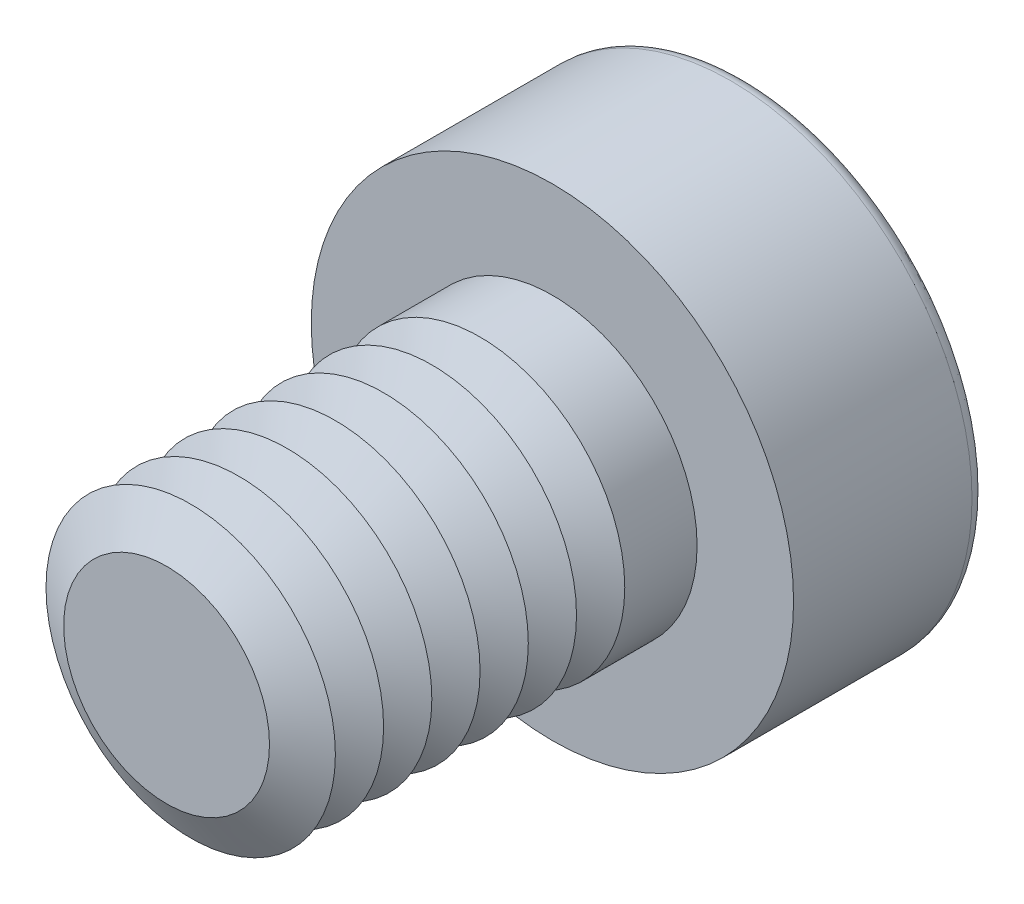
ISO-10303-21;
HEADER;
FILE_DESCRIPTION(('STEP AP214'),'2;1');
FILE_NAME('part.step','',(''),(''),'','','');
FILE_SCHEMA(('AUTOMOTIVE_DESIGN { 1 0 10303 214 1 1 1 1 }'));
ENDSEC;
DATA;
#1=APPLICATION_CONTEXT('core data for automotive mechanical design processes');
#2=APPLICATION_PROTOCOL_DEFINITION('international standard','automotive_design',2000,#1);
#3=PRODUCT_CONTEXT('',#1,'mechanical');
#4=PRODUCT('Part','Part','',(#3));
#5=PRODUCT_RELATED_PRODUCT_CATEGORY('part','',(#4));
#6=PRODUCT_DEFINITION_FORMATION('','',#4);
#7=PRODUCT_DEFINITION_CONTEXT('part definition',#1,'design');
#8=PRODUCT_DEFINITION('design','',#6,#7);
#9=PRODUCT_DEFINITION_SHAPE('','',#8);
#10=(LENGTH_UNIT() NAMED_UNIT(*) SI_UNIT(.MILLI.,.METRE.));
#11=(NAMED_UNIT(*) PLANE_ANGLE_UNIT() SI_UNIT($,.RADIAN.));
#12=(NAMED_UNIT(*) SI_UNIT($,.STERADIAN.) SOLID_ANGLE_UNIT());
#13=UNCERTAINTY_MEASURE_WITH_UNIT(LENGTH_MEASURE(1.E-05),#10,'distance_accuracy_value','');
#14=(GEOMETRIC_REPRESENTATION_CONTEXT(3) GLOBAL_UNCERTAINTY_ASSIGNED_CONTEXT((#13)) GLOBAL_UNIT_ASSIGNED_CONTEXT((#10,
#11,#12)) REPRESENTATION_CONTEXT('',''));
#15=CARTESIAN_POINT('',(0.,0.,0.));
#16=DIRECTION('',(0.,0.,1.));
#17=DIRECTION('',(1.,0.,0.));
#18=AXIS2_PLACEMENT_3D('',#15,#16,#17);
#19=CARTESIAN_POINT('',(0.,0.,4.5));
#20=DIRECTION('',(0.,0.,1.));
#21=DIRECTION('',(1.,0.,0.));
#22=AXIS2_PLACEMENT_3D('',#19,#20,#21);
#23=CONICAL_SURFACE('',#22,3.,1.0471975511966);
#24=CARTESIAN_POINT('',(0.,0.,4.));
#25=DIRECTION('',(0.,0.,1.));
#26=DIRECTION('',(1.,0.,0.));
#27=AXIS2_PLACEMENT_3D('',#24,#25,#26);
#28=CIRCLE('',#27,2.13397459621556);
#29=CARTESIAN_POINT('',(2.13397459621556,0.,4.));
#30=VERTEX_POINT('',#29);
#31=EDGE_CURVE('E311',#30,#30,#28,.T.);
#32=ORIENTED_EDGE('',*,*,#31,.T.);
#33=EDGE_LOOP('',(#32));
#34=FACE_BOUND('',#33,.T.);
#35=CARTESIAN_POINT('',(0.,0.,4.5));
#36=DIRECTION('',(0.,0.,1.));
#37=DIRECTION('',(1.,0.,0.));
#38=AXIS2_PLACEMENT_3D('',#35,#36,#37);
#39=CIRCLE('',#38,3.);
#40=CARTESIAN_POINT('',(3.,0.,4.5));
#41=VERTEX_POINT('',#40);
#42=EDGE_CURVE('E314',#41,#41,#39,.T.);
#43=ORIENTED_EDGE('',*,*,#42,.F.);
#44=EDGE_LOOP('',(#43));
#45=FACE_BOUND('',#44,.T.);
#46=ADVANCED_FACE('F39',(#34,#45),#23,.T.);
#47=CARTESIAN_POINT('',(0.,0.,4.));
#48=DIRECTION('',(0.,0.,-1.));
#49=DIRECTION('',(-1.,0.,0.));
#50=AXIS2_PLACEMENT_3D('',#47,#48,#49);
#51=CONICAL_SURFACE('',#50,2.13397459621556,1.0471975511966);
#52=CARTESIAN_POINT('',(0.,0.,3.5));
#53=DIRECTION('',(0.,0.,1.));
#54=DIRECTION('',(1.,0.,0.));
#55=AXIS2_PLACEMENT_3D('',#52,#53,#54);
#56=CIRCLE('',#55,3.);
#57=CARTESIAN_POINT('',(3.,0.,3.5));
#58=VERTEX_POINT('',#57);
#59=EDGE_CURVE('E322',#58,#58,#56,.T.);
#60=ORIENTED_EDGE('',*,*,#59,.T.);
#61=EDGE_LOOP('',(#60));
#62=FACE_BOUND('',#61,.T.);
#63=ORIENTED_EDGE('',*,*,#31,.F.);
#64=EDGE_LOOP('',(#63));
#65=FACE_BOUND('',#64,.T.);
#66=ADVANCED_FACE('F244',(#62,#65),#51,.T.);
#67=CARTESIAN_POINT('',(0.,0.,8.));
#68=DIRECTION('',(0.,0.,1.));
#69=DIRECTION('',(1.,0.,0.));
#70=AXIS2_PLACEMENT_3D('',#67,#68,#69);
#71=PLANE('',#70);
#72=CARTESIAN_POINT('',(0.,0.,8.));
#73=DIRECTION('',(0.,0.,1.));
#74=DIRECTION('',(1.,0.,0.));
#75=AXIS2_PLACEMENT_3D('',#72,#73,#74);
#76=CIRCLE('',#75,2.13397459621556);
#77=CARTESIAN_POINT('',(2.13397459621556,0.,8.));
#78=VERTEX_POINT('',#77);
#79=EDGE_CURVE('E173',#78,#78,#76,.T.);
#80=ORIENTED_EDGE('',*,*,#79,.T.);
#81=EDGE_LOOP('',(#80));
#82=FACE_BOUND('',#81,.T.);
#83=ADVANCED_FACE('F250',(#82),#71,.T.);
#84=CARTESIAN_POINT('',(0.,0.,8.));
#85=DIRECTION('',(0.,0.,-1.));
#86=DIRECTION('',(-1.,0.,0.));
#87=AXIS2_PLACEMENT_3D('',#84,#85,#86);
#88=CONICAL_SURFACE('',#87,2.13397459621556,1.0471975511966);
#89=CARTESIAN_POINT('',(0.,0.,7.5));
#90=DIRECTION('',(0.,0.,1.));
#91=DIRECTION('',(1.,0.,0.));
#92=AXIS2_PLACEMENT_3D('',#89,#90,#91);
#93=CIRCLE('',#92,3.);
#94=CARTESIAN_POINT('',(3.,0.,7.5));
#95=VERTEX_POINT('',#94);
#96=EDGE_CURVE('E290',#95,#95,#93,.T.);
#97=ORIENTED_EDGE('',*,*,#96,.T.);
#98=EDGE_LOOP('',(#97));
#99=FACE_BOUND('',#98,.T.);
#100=ORIENTED_EDGE('',*,*,#79,.F.);
#101=EDGE_LOOP('',(#100));
#102=FACE_BOUND('',#101,.T.);
#103=ADVANCED_FACE('F198',(#99,#102),#88,.T.);
#104=CARTESIAN_POINT('',(0.,0.,7.5));
#105=DIRECTION('',(0.,0.,1.));
#106=DIRECTION('',(1.,0.,0.));
#107=AXIS2_PLACEMENT_3D('',#104,#105,#106);
#108=CONICAL_SURFACE('',#107,3.,1.0471975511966);
#109=CARTESIAN_POINT('',(0.,0.,7.));
#110=DIRECTION('',(0.,0.,1.));
#111=DIRECTION('',(1.,0.,0.));
#112=AXIS2_PLACEMENT_3D('',#109,#110,#111);
#113=CIRCLE('',#112,2.13397459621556);
#114=CARTESIAN_POINT('',(2.13397459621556,0.,7.));
#115=VERTEX_POINT('',#114);
#116=EDGE_CURVE('E287',#115,#115,#113,.T.);
#117=ORIENTED_EDGE('',*,*,#116,.T.);
#118=EDGE_LOOP('',(#117));
#119=FACE_BOUND('',#118,.T.);
#120=ORIENTED_EDGE('',*,*,#96,.F.);
#121=EDGE_LOOP('',(#120));
#122=FACE_BOUND('',#121,.T.);
#123=ADVANCED_FACE('F276',(#119,#122),#108,.T.);
#124=CARTESIAN_POINT('',(0.,0.,7.));
#125=DIRECTION('',(0.,0.,-1.));
#126=DIRECTION('',(-1.,0.,0.));
#127=AXIS2_PLACEMENT_3D('',#124,#125,#126);
#128=CONICAL_SURFACE('',#127,2.13397459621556,1.0471975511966);
#129=CARTESIAN_POINT('',(0.,0.,6.5));
#130=DIRECTION('',(0.,0.,1.));
#131=DIRECTION('',(1.,0.,0.));
#132=AXIS2_PLACEMENT_3D('',#129,#130,#131);
#133=CIRCLE('',#132,3.);
#134=CARTESIAN_POINT('',(3.,0.,6.5));
#135=VERTEX_POINT('',#134);
#136=EDGE_CURVE('E298',#135,#135,#133,.T.);
#137=ORIENTED_EDGE('',*,*,#136,.T.);
#138=EDGE_LOOP('',(#137));
#139=FACE_BOUND('',#138,.T.);
#140=ORIENTED_EDGE('',*,*,#116,.F.);
#141=EDGE_LOOP('',(#140));
#142=FACE_BOUND('',#141,.T.);
#143=ADVANCED_FACE('F273',(#139,#142),#128,.T.);
#144=CARTESIAN_POINT('',(0.,0.,6.5));
#145=DIRECTION('',(0.,0.,1.));
#146=DIRECTION('',(1.,0.,0.));
#147=AXIS2_PLACEMENT_3D('',#144,#145,#146);
#148=CONICAL_SURFACE('',#147,3.,1.0471975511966);
#149=CARTESIAN_POINT('',(0.,0.,6.));
#150=DIRECTION('',(0.,0.,1.));
#151=DIRECTION('',(1.,0.,0.));
#152=AXIS2_PLACEMENT_3D('',#149,#150,#151);
#153=CIRCLE('',#152,2.13397459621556);
#154=CARTESIAN_POINT('',(2.13397459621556,0.,6.));
#155=VERTEX_POINT('',#154);
#156=EDGE_CURVE('E292',#155,#155,#153,.T.);
#157=ORIENTED_EDGE('',*,*,#156,.T.);
#158=EDGE_LOOP('',(#157));
#159=FACE_BOUND('',#158,.T.);
#160=ORIENTED_EDGE('',*,*,#136,.F.);
#161=EDGE_LOOP('',(#160));
#162=FACE_BOUND('',#161,.T.);
#163=ADVANCED_FACE('F269',(#159,#162),#148,.T.);
#164=CARTESIAN_POINT('',(0.,0.,6.));
#165=DIRECTION('',(0.,0.,-1.));
#166=DIRECTION('',(-1.,0.,0.));
#167=AXIS2_PLACEMENT_3D('',#164,#165,#166);
#168=CONICAL_SURFACE('',#167,2.13397459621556,1.0471975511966);
#169=CARTESIAN_POINT('',(0.,0.,5.5));
#170=DIRECTION('',(0.,0.,1.));
#171=DIRECTION('',(1.,0.,0.));
#172=AXIS2_PLACEMENT_3D('',#169,#170,#171);
#173=CIRCLE('',#172,3.);
#174=CARTESIAN_POINT('',(3.,0.,5.5));
#175=VERTEX_POINT('',#174);
#176=EDGE_CURVE('E307',#175,#175,#173,.T.);
#177=ORIENTED_EDGE('',*,*,#176,.T.);
#178=EDGE_LOOP('',(#177));
#179=FACE_BOUND('',#178,.T.);
#180=ORIENTED_EDGE('',*,*,#156,.F.);
#181=EDGE_LOOP('',(#180));
#182=FACE_BOUND('',#181,.T.);
#183=ADVANCED_FACE('F265',(#179,#182),#168,.T.);
#184=CARTESIAN_POINT('',(0.,0.,5.5));
#185=DIRECTION('',(0.,0.,1.));
#186=DIRECTION('',(1.,0.,0.));
#187=AXIS2_PLACEMENT_3D('',#184,#185,#186);
#188=CONICAL_SURFACE('',#187,3.,1.0471975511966);
#189=CARTESIAN_POINT('',(0.,0.,5.));
#190=DIRECTION('',(0.,0.,1.));
#191=DIRECTION('',(1.,0.,0.));
#192=AXIS2_PLACEMENT_3D('',#189,#190,#191);
#193=CIRCLE('',#192,2.13397459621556);
#194=CARTESIAN_POINT('',(2.13397459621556,0.,5.));
#195=VERTEX_POINT('',#194);
#196=EDGE_CURVE('E304',#195,#195,#193,.T.);
#197=ORIENTED_EDGE('',*,*,#196,.T.);
#198=EDGE_LOOP('',(#197));
#199=FACE_BOUND('',#198,.T.);
#200=ORIENTED_EDGE('',*,*,#176,.F.);
#201=EDGE_LOOP('',(#200));
#202=FACE_BOUND('',#201,.T.);
#203=ADVANCED_FACE('F261',(#199,#202),#188,.T.);
#204=CARTESIAN_POINT('',(0.,0.,5.));
#205=DIRECTION('',(0.,0.,-1.));
#206=DIRECTION('',(-1.,0.,0.));
#207=AXIS2_PLACEMENT_3D('',#204,#205,#206);
#208=CONICAL_SURFACE('',#207,2.13397459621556,1.0471975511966);
#209=ORIENTED_EDGE('',*,*,#42,.T.);
#210=EDGE_LOOP('',(#209));
#211=FACE_BOUND('',#210,.T.);
#212=ORIENTED_EDGE('',*,*,#196,.F.);
#213=EDGE_LOOP('',(#212));
#214=FACE_BOUND('',#213,.T.);
#215=ADVANCED_FACE('F257',(#211,#214),#208,.T.);
#216=CARTESIAN_POINT('',(0.,0.,3.5));
#217=DIRECTION('',(0.,0.,1.));
#218=DIRECTION('',(1.,0.,0.));
#219=AXIS2_PLACEMENT_3D('',#216,#217,#218);
#220=CONICAL_SURFACE('',#219,3.,1.0471975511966);
#221=CARTESIAN_POINT('',(0.,0.,3.));
#222=DIRECTION('',(0.,0.,1.));
#223=DIRECTION('',(1.,0.,0.));
#224=AXIS2_PLACEMENT_3D('',#221,#222,#223);
#225=CIRCLE('',#224,2.13397459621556);
#226=CARTESIAN_POINT('',(2.13397459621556,0.,3.));
#227=VERTEX_POINT('',#226);
#228=EDGE_CURVE('E318',#227,#227,#225,.T.);
#229=ORIENTED_EDGE('',*,*,#228,.T.);
#230=EDGE_LOOP('',(#229));
#231=FACE_BOUND('',#230,.T.);
#232=ORIENTED_EDGE('',*,*,#59,.F.);
#233=EDGE_LOOP('',(#232));
#234=FACE_BOUND('',#233,.T.);
#235=ADVANCED_FACE('F260',(#231,#234),#220,.T.);
#236=CARTESIAN_POINT('',(0.,0.,3.));
#237=DIRECTION('',(0.,0.,-1.));
#238=DIRECTION('',(-1.,0.,0.));
#239=AXIS2_PLACEMENT_3D('',#236,#237,#238);
#240=CONICAL_SURFACE('',#239,2.13397459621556,1.0471975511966);
#241=CARTESIAN_POINT('',(0.,0.,2.5));
#242=DIRECTION('',(0.,0.,1.));
#243=DIRECTION('',(1.,0.,0.));
#244=AXIS2_PLACEMENT_3D('',#241,#242,#243);
#245=CIRCLE('',#244,3.);
#246=CARTESIAN_POINT('',(3.,0.,2.5));
#247=VERTEX_POINT('',#246);
#248=EDGE_CURVE('E334',#247,#247,#245,.T.);
#249=ORIENTED_EDGE('',*,*,#248,.T.);
#250=EDGE_LOOP('',(#249));
#251=FACE_BOUND('',#250,.T.);
#252=ORIENTED_EDGE('',*,*,#228,.F.);
#253=EDGE_LOOP('',(#252));
#254=FACE_BOUND('',#253,.T.);
#255=ADVANCED_FACE('F341',(#251,#254),#240,.T.);
#256=CARTESIAN_POINT('',(0.,0.,2.5));
#257=DIRECTION('',(0.,0.,1.));
#258=DIRECTION('',(1.,0.,0.));
#259=AXIS2_PLACEMENT_3D('',#256,#257,#258);
#260=CONICAL_SURFACE('',#259,3.,1.0471975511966);
#261=CARTESIAN_POINT('',(0.,0.,2.));
#262=DIRECTION('',(0.,0.,1.));
#263=DIRECTION('',(1.,0.,0.));
#264=AXIS2_PLACEMENT_3D('',#261,#262,#263);
#265=CIRCLE('',#264,2.13397459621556);
#266=CARTESIAN_POINT('',(2.13397459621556,0.,2.));
#267=VERTEX_POINT('',#266);
#268=EDGE_CURVE('E326',#267,#267,#265,.T.);
#269=ORIENTED_EDGE('',*,*,#268,.T.);
#270=EDGE_LOOP('',(#269));
#271=FACE_BOUND('',#270,.T.);
#272=ORIENTED_EDGE('',*,*,#248,.F.);
#273=EDGE_LOOP('',(#272));
#274=FACE_BOUND('',#273,.T.);
#275=ADVANCED_FACE('F344',(#271,#274),#260,.T.);
#276=CARTESIAN_POINT('',(0.,0.,2.));
#277=DIRECTION('',(0.,0.,-1.));
#278=DIRECTION('',(-1.,0.,0.));
#279=AXIS2_PLACEMENT_3D('',#276,#277,#278);
#280=CONICAL_SURFACE('',#279,2.13397459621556,1.0471975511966);
#281=CARTESIAN_POINT('',(0.,0.,1.5));
#282=DIRECTION('',(0.,0.,1.));
#283=DIRECTION('',(1.,0.,0.));
#284=AXIS2_PLACEMENT_3D('',#281,#282,#283);
#285=CIRCLE('',#284,3.);
#286=CARTESIAN_POINT('',(3.,0.,1.5));
#287=VERTEX_POINT('',#286);
#288=EDGE_CURVE('E330',#287,#287,#285,.T.);
#289=ORIENTED_EDGE('',*,*,#288,.T.);
#290=EDGE_LOOP('',(#289));
#291=FACE_BOUND('',#290,.T.);
#292=ORIENTED_EDGE('',*,*,#268,.F.);
#293=EDGE_LOOP('',(#292));
#294=FACE_BOUND('',#293,.T.);
#295=ADVANCED_FACE('F346',(#291,#294),#280,.T.);
#296=CARTESIAN_POINT('',(0.,0.,-1.));
#297=DIRECTION('',(0.,0.,-1.));
#298=DIRECTION('',(-1.,0.,0.));
#299=AXIS2_PLACEMENT_3D('',#296,#297,#298);
#300=CONICAL_SURFACE('',#299,2.,1.0471975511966);
#301=CARTESIAN_POINT('',(0.,0.,0.154700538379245));
#302=VERTEX_POINT('',#301);
#303=VERTEX_LOOP('',#302);
#304=FACE_BOUND('',#303,.T.);
#305=CARTESIAN_POINT('',(0.,0.,-1.));
#306=DIRECTION('',(0.,0.,-1.));
#307=DIRECTION('',(-1.,0.,0.));
#308=AXIS2_PLACEMENT_3D('',#305,#306,#307);
#309=CIRCLE('',#308,2.);
#310=CARTESIAN_POINT('',(-1.73205080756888,1.,-1.));
#311=VERTEX_POINT('',#310);
#312=CARTESIAN_POINT('',(0.,2.,-1.));
#313=VERTEX_POINT('',#312);
#314=EDGE_CURVE('E149',#311,#313,#309,.T.);
#315=ORIENTED_EDGE('',*,*,#314,.T.);
#316=CARTESIAN_POINT('',(0.,0.,-1.));
#317=DIRECTION('',(0.,0.,-1.));
#318=DIRECTION('',(-1.,0.,0.));
#319=AXIS2_PLACEMENT_3D('',#316,#317,#318);
#320=CIRCLE('',#319,2.);
#321=CARTESIAN_POINT('',(1.73205080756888,1.,-1.));
#322=VERTEX_POINT('',#321);
#323=EDGE_CURVE('E54',#313,#322,#320,.T.);
#324=ORIENTED_EDGE('',*,*,#323,.T.);
#325=CARTESIAN_POINT('',(1.73205080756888,-1.,-1.));
#326=VERTEX_POINT('',#325);
#327=EDGE_CURVE('E726',#322,#326,#320,.T.);
#328=ORIENTED_EDGE('',*,*,#327,.T.);
#329=CARTESIAN_POINT('',(0.,-2.,-1.));
#330=VERTEX_POINT('',#329);
#331=EDGE_CURVE('E724',#326,#330,#320,.T.);
#332=ORIENTED_EDGE('',*,*,#331,.T.);
#333=CARTESIAN_POINT('',(-1.73205080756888,-1.,-1.));
#334=VERTEX_POINT('',#333);
#335=EDGE_CURVE('E720',#330,#334,#320,.T.);
#336=ORIENTED_EDGE('',*,*,#335,.T.);
#337=EDGE_CURVE('E718',#334,#311,#320,.T.);
#338=ORIENTED_EDGE('',*,*,#337,.T.);
#339=EDGE_LOOP('',(#315,#324,#328,#332,#336,#338));
#340=FACE_BOUND('',#339,.T.);
#341=ADVANCED_FACE('F200',(#304,#340),#300,.F.);
#342=CARTESIAN_POINT('',(0.,0.,-1.));
#343=DIRECTION('',(0.,0.,-1.));
#344=DIRECTION('',(-1.,0.,0.));
#345=AXIS2_PLACEMENT_3D('',#342,#343,#344);
#346=PLANE('',#345);
#347=ORIENTED_EDGE('',*,*,#323,.F.);
#348=DIRECTION('',(1.,0.,0.));
#349=VECTOR('',#348,1.);
#350=CARTESIAN_POINT('',(-1.15470053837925,2.,-1.));
#351=LINE('',#350,#349);
#352=CARTESIAN_POINT('',(1.15470053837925,2.,-1.));
#353=VERTEX_POINT('',#352);
#354=EDGE_CURVE('E768',#313,#353,#351,.T.);
#355=ORIENTED_EDGE('',*,*,#354,.T.);
#356=DIRECTION('',(0.5,-0.866025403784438,0.));
#357=VECTOR('',#356,1.);
#358=CARTESIAN_POINT('',(1.15470053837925,2.,-1.));
#359=LINE('',#358,#357);
#360=EDGE_CURVE('E155',#353,#322,#359,.T.);
#361=ORIENTED_EDGE('',*,*,#360,.T.);
#362=EDGE_LOOP('',(#347,#355,#361));
#363=FACE_BOUND('',#362,.T.);
#364=ADVANCED_FACE('F386',(#363),#346,.T.);
#365=ORIENTED_EDGE('',*,*,#327,.F.);
#366=CARTESIAN_POINT('',(2.3094010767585,0.,-1.));
#367=VERTEX_POINT('',#366);
#368=EDGE_CURVE('E762',#322,#367,#359,.T.);
#369=ORIENTED_EDGE('',*,*,#368,.T.);
#370=DIRECTION('',(-0.5,-0.866025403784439,0.));
#371=VECTOR('',#370,1.);
#372=CARTESIAN_POINT('',(2.3094010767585,0.,-1.));
#373=LINE('',#372,#371);
#374=EDGE_CURVE('E740',#367,#326,#373,.T.);
#375=ORIENTED_EDGE('',*,*,#374,.T.);
#376=EDGE_LOOP('',(#365,#369,#375));
#377=FACE_BOUND('',#376,.T.);
#378=ADVANCED_FACE('F396',(#377),#346,.T.);
#379=ORIENTED_EDGE('',*,*,#331,.F.);
#380=CARTESIAN_POINT('',(1.15470053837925,-2.,-1.));
#381=VERTEX_POINT('',#380);
#382=EDGE_CURVE('E742',#326,#381,#373,.T.);
#383=ORIENTED_EDGE('',*,*,#382,.T.);
#384=DIRECTION('',(-1.,0.,0.));
#385=VECTOR('',#384,1.);
#386=CARTESIAN_POINT('',(1.15470053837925,-2.,-1.));
#387=LINE('',#386,#385);
#388=EDGE_CURVE('E692',#381,#330,#387,.T.);
#389=ORIENTED_EDGE('',*,*,#388,.T.);
#390=EDGE_LOOP('',(#379,#383,#389));
#391=FACE_BOUND('',#390,.T.);
#392=ADVANCED_FACE('F406',(#391),#346,.T.);
#393=ORIENTED_EDGE('',*,*,#335,.F.);
#394=CARTESIAN_POINT('',(-1.15470053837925,-2.,-1.));
#395=VERTEX_POINT('',#394);
#396=EDGE_CURVE('E736',#330,#395,#387,.T.);
#397=ORIENTED_EDGE('',*,*,#396,.T.);
#398=DIRECTION('',(-0.5,0.866025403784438,0.));
#399=VECTOR('',#398,1.);
#400=CARTESIAN_POINT('',(-1.15470053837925,-2.,-1.));
#401=LINE('',#400,#399);
#402=EDGE_CURVE('E738',#395,#334,#401,.T.);
#403=ORIENTED_EDGE('',*,*,#402,.T.);
#404=EDGE_LOOP('',(#393,#397,#403));
#405=FACE_BOUND('',#404,.T.);
#406=ADVANCED_FACE('F414',(#405),#346,.T.);
#407=ORIENTED_EDGE('',*,*,#337,.F.);
#408=CARTESIAN_POINT('',(-2.3094010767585,0.,-1.));
#409=VERTEX_POINT('',#408);
#410=EDGE_CURVE('E743',#334,#409,#401,.T.);
#411=ORIENTED_EDGE('',*,*,#410,.T.);
#412=DIRECTION('',(0.5,0.866025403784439,0.));
#413=VECTOR('',#412,1.);
#414=CARTESIAN_POINT('',(-2.3094010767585,0.,-1.));
#415=LINE('',#414,#413);
#416=EDGE_CURVE('E158',#409,#311,#415,.T.);
#417=ORIENTED_EDGE('',*,*,#416,.T.);
#418=EDGE_LOOP('',(#407,#411,#417));
#419=FACE_BOUND('',#418,.T.);
#420=ADVANCED_FACE('F230',(#419),#346,.T.);
#421=ORIENTED_EDGE('',*,*,#314,.F.);
#422=CARTESIAN_POINT('',(-1.15470053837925,2.,-1.));
#423=VERTEX_POINT('',#422);
#424=EDGE_CURVE('E750',#311,#423,#415,.T.);
#425=ORIENTED_EDGE('',*,*,#424,.T.);
#426=EDGE_CURVE('E763',#423,#313,#351,.T.);
#427=ORIENTED_EDGE('',*,*,#426,.T.);
#428=EDGE_LOOP('',(#421,#425,#427));
#429=FACE_BOUND('',#428,.T.);
#430=ADVANCED_FACE('F398',(#429),#346,.T.);
#431=CARTESIAN_POINT('',(-1.15470053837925,2.,-1.));
#432=DIRECTION('',(0.,1.,0.));
#433=DIRECTION('',(0.,0.,1.));
#434=AXIS2_PLACEMENT_3D('',#431,#432,#433);
#435=PLANE('',#434);
#436=DIRECTION('',(0.,0.,-1.));
#437=VECTOR('',#436,1.);
#438=CARTESIAN_POINT('',(-1.15470053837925,2.,-1.));
#439=LINE('',#438,#437);
#440=CARTESIAN_POINT('',(-1.15470053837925,2.,-4.));
#441=VERTEX_POINT('',#440);
#442=EDGE_CURVE('E147',#423,#441,#439,.T.);
#443=ORIENTED_EDGE('',*,*,#442,.T.);
#444=CARTESIAN_POINT('',(-3.01440758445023,2.,-4.35051689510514));
#445=CARTESIAN_POINT('',(-2.92409762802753,2.,-4.33035636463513));
#446=CARTESIAN_POINT('',(-2.83373054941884,2.,-4.31045254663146));
#447=CARTESIAN_POINT('',(-2.65285291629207,2.,-4.27128852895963));
#448=CARTESIAN_POINT('',(-2.562342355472,2.,-4.25202835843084));
#449=CARTESIAN_POINT('',(-2.29037985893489,2.,-4.19537300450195));
#450=CARTESIAN_POINT('',(-2.10868043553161,2.,-4.15914446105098));
#451=CARTESIAN_POINT('',(-1.74597297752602,2.,-4.09171688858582));
#452=CARTESIAN_POINT('',(-1.56497266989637,2.,-4.06047686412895));
#453=CARTESIAN_POINT('',(-1.20186568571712,2.,-4.00513826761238));
#454=CARTESIAN_POINT('',(-1.01975924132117,2.,-3.98103824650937));
#455=CARTESIAN_POINT('',(-0.744747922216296,2.,-3.9525901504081));
#456=CARTESIAN_POINT('',(-0.652245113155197,2.,-3.9443671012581));
#457=CARTESIAN_POINT('',(-0.467020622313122,2.,-3.93099406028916));
#458=CARTESIAN_POINT('',(-0.374298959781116,2.,-3.92584380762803));
#459=CARTESIAN_POINT('',(-0.188764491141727,2.,-3.91891540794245));
#460=CARTESIAN_POINT('',(-0.0959517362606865,2.,-3.91713591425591));
#461=CARTESIAN_POINT('',(0.0896753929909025,2.,-3.91705786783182));
#462=CARTESIAN_POINT('',(0.182489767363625,2.,-3.91875932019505));
#463=CARTESIAN_POINT('',(0.368369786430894,2.,-3.92554892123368));
#464=CARTESIAN_POINT('',(0.461434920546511,2.,-3.93065079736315));
#465=CARTESIAN_POINT('',(0.647346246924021,2.,-3.94395663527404));
#466=CARTESIAN_POINT('',(0.740192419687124,2.,-3.95216086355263));
#467=CARTESIAN_POINT('',(1.01841374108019,2.,-3.98081777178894));
#468=CARTESIAN_POINT('',(1.2033713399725,2.,-4.00531018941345));
#469=CARTESIAN_POINT('',(1.57694396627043,2.,-4.06236202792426));
#470=CARTESIAN_POINT('',(1.76552771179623,2.,-4.09511615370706));
#471=CARTESIAN_POINT('',(2.14178491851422,2.,-4.1655706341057));
#472=CARTESIAN_POINT('',(2.32945822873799,2.,-4.20327178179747));
#473=CARTESIAN_POINT('',(2.70417911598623,2.,-4.28188312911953));
#474=CARTESIAN_POINT('',(2.89122649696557,2.,-4.32279425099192));
#475=CARTESIAN_POINT('',(3.26484478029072,2.,-4.40674298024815));
#476=CARTESIAN_POINT('',(3.45141567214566,2.,-4.44978063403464));
#477=CARTESIAN_POINT('',(3.821938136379,2.,-4.53678178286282));
#478=CARTESIAN_POINT('',(4.00589388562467,2.,-4.58072756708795));
#479=CARTESIAN_POINT('',(4.37356350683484,2.,-4.66963526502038));
#480=CARTESIAN_POINT('',(4.55727737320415,2.,-4.71459720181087));
#481=CARTESIAN_POINT('',(4.9242660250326,2.,-4.80519833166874));
#482=CARTESIAN_POINT('',(5.10754106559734,2.,-4.85083649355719));
#483=CARTESIAN_POINT('',(5.47394280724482,2.,-4.94267693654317));
#484=CARTESIAN_POINT('',(5.65706951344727,2.,-4.98887919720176));
#485=CARTESIAN_POINT('',(5.84014583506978,2.,-5.03527803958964));
#486=B_SPLINE_CURVE_WITH_KNOTS('',3,(#444,#445,#446,#447,#448,#449,#450,#451,#452,#453,#454,
#455,#456,#457,#458,#459,#460,#461,#462,#463,#464,#465,#466,#467,#468,#469,#470,#471,#472,#473,
#474,#475,#476,#477,#478,#479,#480,#481,#482,#483,#484,#485),.UNSPECIFIED.,.F.,.F.,(4,2,2,2,2,2,
2,2,2,2,2,2,2,2,2,2,2,2,2,2,4),(0.,0.277597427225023,0.555207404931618,1.11099118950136,
1.66194208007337,2.21278108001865,2.49134108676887,2.76987744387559,3.04830249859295,
3.32672796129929,3.60628428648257,3.88586463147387,4.44532615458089,5.0194589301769,
5.59368385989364,6.16807437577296,6.74247743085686,7.30986991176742,7.87727529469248,
8.44388991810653,9.01048407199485),.UNSPECIFIED.);
#487=CARTESIAN_POINT('',(1.15470053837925,2.,-4.));
#488=VERTEX_POINT('',#487);
#489=EDGE_CURVE('E124',#441,#488,#486,.T.);
#490=ORIENTED_EDGE('',*,*,#489,.T.);
#491=DIRECTION('',(0.,0.,-1.));
#492=VECTOR('',#491,1.);
#493=CARTESIAN_POINT('',(1.15470053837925,2.,-1.));
#494=LINE('',#493,#492);
#495=EDGE_CURVE('E143',#353,#488,#494,.T.);
#496=ORIENTED_EDGE('',*,*,#495,.F.);
#497=ORIENTED_EDGE('',*,*,#354,.F.);
#498=ORIENTED_EDGE('',*,*,#426,.F.);
#499=EDGE_LOOP('',(#443,#490,#496,#497,#498));
#500=FACE_BOUND('',#499,.T.);
#501=ADVANCED_FACE('F141',(#500),#435,.F.);
#502=CARTESIAN_POINT('',(1.15470053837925,2.,-1.));
#503=DIRECTION('',(0.866025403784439,0.5,0.));
#504=DIRECTION('',(-0.5,0.866025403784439,0.));
#505=AXIS2_PLACEMENT_3D('',#502,#503,#504);
#506=PLANE('',#505);
#507=ORIENTED_EDGE('',*,*,#495,.T.);
#508=CARTESIAN_POINT('',(1.15458506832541,2.0002,-4.00003094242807));
#509=CARTESIAN_POINT('',(1.20254643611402,1.91712847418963,-3.98717294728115));
#510=CARTESIAN_POINT('',(1.25059477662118,1.83390630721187,-3.97549990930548));
#511=CARTESIAN_POINT('',(1.3468611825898,1.66716800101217,-3.95499135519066));
#512=CARTESIAN_POINT('',(1.39507930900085,1.58365175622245,-3.94615699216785));
#513=CARTESIAN_POINT('',(1.49139287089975,1.41683177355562,-3.93184164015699));
#514=CARTESIAN_POINT('',(1.53948765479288,1.33352916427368,-3.92634357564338));
#515=CARTESIAN_POINT('',(1.63573857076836,1.1668176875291,-3.91897122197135));
#516=CARTESIAN_POINT('',(1.68389468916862,1.08340884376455,-3.91709623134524));
#517=CARTESIAN_POINT('',(1.78020692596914,0.916591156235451,-3.91709623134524));
#518=CARTESIAN_POINT('',(1.82836304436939,0.833182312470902,-3.91897122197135));
#519=CARTESIAN_POINT('',(1.92461396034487,0.666470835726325,-3.92634357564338));
#520=CARTESIAN_POINT('',(1.972708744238,0.583168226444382,-3.93184164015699));
#521=CARTESIAN_POINT('',(2.0690223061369,0.416348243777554,-3.94615699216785));
#522=CARTESIAN_POINT('',(2.11724043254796,0.332831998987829,-3.95499135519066));
#523=CARTESIAN_POINT('',(2.21350683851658,0.16609369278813,-3.97549990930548));
#524=CARTESIAN_POINT('',(2.26155517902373,0.0828715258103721,-3.98717294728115));
#525=CARTESIAN_POINT('',(2.30951654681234,-0.000199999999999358,-4.00003094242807));
#526=B_SPLINE_CURVE_WITH_KNOTS('',3,(#508,#509,#510,#511,#512,#513,#514,#515,#516,#517,#518,
#519,#520,#521,#522,#523,#524,#525),.UNSPECIFIED.,.F.,.F.,(4,2,2,2,2,2,2,2,4),(0.,
0.29035724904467,0.580832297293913,0.869807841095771,1.15872743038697,1.44764701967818,
1.73662256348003,2.02709761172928,2.31745486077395),.UNSPECIFIED.);
#527=CARTESIAN_POINT('',(2.3094010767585,0.,-4.));
#528=VERTEX_POINT('',#527);
#529=EDGE_CURVE('E11',#488,#528,#526,.T.);
#530=ORIENTED_EDGE('',*,*,#529,.T.);
#531=DIRECTION('',(0.,0.,-1.));
#532=VECTOR('',#531,1.);
#533=CARTESIAN_POINT('',(2.3094010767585,0.,-1.));
#534=LINE('',#533,#532);
#535=EDGE_CURVE('E157',#367,#528,#534,.T.);
#536=ORIENTED_EDGE('',*,*,#535,.F.);
#537=ORIENTED_EDGE('',*,*,#368,.F.);
#538=ORIENTED_EDGE('',*,*,#360,.F.);
#539=EDGE_LOOP('',(#507,#530,#536,#537,#538));
#540=FACE_BOUND('',#539,.T.);
#541=ADVANCED_FACE('F152',(#540),#506,.F.);
#542=CARTESIAN_POINT('',(2.3094010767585,0.,-1.));
#543=DIRECTION('',(0.866025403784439,-0.5,0.));
#544=DIRECTION('',(0.5,0.866025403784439,0.));
#545=AXIS2_PLACEMENT_3D('',#542,#543,#544);
#546=PLANE('',#545);
#547=ORIENTED_EDGE('',*,*,#535,.T.);
#548=CARTESIAN_POINT('',(2.30951654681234,0.000200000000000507,-4.00003094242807));
#549=CARTESIAN_POINT('',(2.26155517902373,-0.0828715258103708,-3.98717294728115));
#550=CARTESIAN_POINT('',(2.21350683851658,-0.166093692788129,-3.97549990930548));
#551=CARTESIAN_POINT('',(2.11724043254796,-0.332831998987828,-3.95499135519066));
#552=CARTESIAN_POINT('',(2.0690223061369,-0.416348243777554,-3.94615699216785));
#553=CARTESIAN_POINT('',(1.972708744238,-0.583168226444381,-3.93184164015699));
#554=CARTESIAN_POINT('',(1.92461396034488,-0.666470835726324,-3.92634357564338));
#555=CARTESIAN_POINT('',(1.82836304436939,-0.833182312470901,-3.91897122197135));
#556=CARTESIAN_POINT('',(1.78020692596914,-0.916591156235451,-3.91709623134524));
#557=CARTESIAN_POINT('',(1.68389468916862,-1.08340884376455,-3.91709623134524));
#558=CARTESIAN_POINT('',(1.63573857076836,-1.1668176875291,-3.91897122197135));
#559=CARTESIAN_POINT('',(1.53948765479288,-1.33352916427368,-3.92634357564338));
#560=CARTESIAN_POINT('',(1.49139287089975,-1.41683177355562,-3.93184164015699));
#561=CARTESIAN_POINT('',(1.39507930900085,-1.58365175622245,-3.94615699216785));
#562=CARTESIAN_POINT('',(1.3468611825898,-1.66716800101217,-3.95499135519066));
#563=CARTESIAN_POINT('',(1.25059477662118,-1.83390630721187,-3.97549990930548));
#564=CARTESIAN_POINT('',(1.20254643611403,-1.91712847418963,-3.98717294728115));
#565=CARTESIAN_POINT('',(1.15458506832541,-2.0002,-4.00003094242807));
#566=B_SPLINE_CURVE_WITH_KNOTS('',3,(#548,#549,#550,#551,#552,#553,#554,#555,#556,#557,#558,
#559,#560,#561,#562,#563,#564,#565),.UNSPECIFIED.,.F.,.F.,(4,2,2,2,2,2,2,2,4),(0.,
0.290357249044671,0.580832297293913,0.869807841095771,1.15872743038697,1.44764701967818,
1.73662256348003,2.02709761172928,2.31745486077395),.UNSPECIFIED.);
#567=CARTESIAN_POINT('',(1.15470053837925,-2.,-4.));
#568=VERTEX_POINT('',#567);
#569=EDGE_CURVE('E172',#528,#568,#566,.T.);
#570=ORIENTED_EDGE('',*,*,#569,.T.);
#571=DIRECTION('',(0.,0.,-1.));
#572=VECTOR('',#571,1.);
#573=CARTESIAN_POINT('',(1.15470053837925,-2.,-1.));
#574=LINE('',#573,#572);
#575=EDGE_CURVE('E687',#381,#568,#574,.T.);
#576=ORIENTED_EDGE('',*,*,#575,.F.);
#577=ORIENTED_EDGE('',*,*,#382,.F.);
#578=ORIENTED_EDGE('',*,*,#374,.F.);
#579=EDGE_LOOP('',(#547,#570,#576,#577,#578));
#580=FACE_BOUND('',#579,.T.);
#581=ADVANCED_FACE('F190',(#580),#546,.F.);
#582=CARTESIAN_POINT('',(1.15470053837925,-2.,-1.));
#583=DIRECTION('',(0.,-1.,0.));
#584=DIRECTION('',(0.,0.,-1.));
#585=AXIS2_PLACEMENT_3D('',#582,#583,#584);
#586=PLANE('',#585);
#587=ORIENTED_EDGE('',*,*,#575,.T.);
#588=CARTESIAN_POINT('',(-3.01440758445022,-2.,-4.35051689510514));
#589=CARTESIAN_POINT('',(-2.92409762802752,-2.,-4.33035636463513));
#590=CARTESIAN_POINT('',(-2.83373054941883,-2.,-4.31045254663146));
#591=CARTESIAN_POINT('',(-2.65285291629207,-2.,-4.27128852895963));
#592=CARTESIAN_POINT('',(-2.562342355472,-2.,-4.25202835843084));
#593=CARTESIAN_POINT('',(-2.29037985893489,-2.,-4.19537300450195));
#594=CARTESIAN_POINT('',(-2.10868043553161,-2.,-4.15914446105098));
#595=CARTESIAN_POINT('',(-1.74597297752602,-2.,-4.09171688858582));
#596=CARTESIAN_POINT('',(-1.56497266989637,-2.,-4.06047686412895));
#597=CARTESIAN_POINT('',(-1.20186568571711,-2.,-4.00513826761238));
#598=CARTESIAN_POINT('',(-1.01975924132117,-2.,-3.98103824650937));
#599=CARTESIAN_POINT('',(-0.744747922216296,-2.,-3.9525901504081));
#600=CARTESIAN_POINT('',(-0.652245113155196,-2.,-3.9443671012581));
#601=CARTESIAN_POINT('',(-0.467020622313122,-2.,-3.93099406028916));
#602=CARTESIAN_POINT('',(-0.374298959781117,-2.,-3.92584380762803));
#603=CARTESIAN_POINT('',(-0.188764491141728,-2.,-3.91891540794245));
#604=CARTESIAN_POINT('',(-0.0959517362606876,-2.,-3.91713591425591));
#605=CARTESIAN_POINT('',(0.089675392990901,-2.,-3.91705786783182));
#606=CARTESIAN_POINT('',(0.182489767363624,-2.,-3.91875932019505));
#607=CARTESIAN_POINT('',(0.368369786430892,-2.,-3.92554892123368));
#608=CARTESIAN_POINT('',(0.461434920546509,-2.,-3.93065079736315));
#609=CARTESIAN_POINT('',(0.647346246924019,-2.,-3.94395663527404));
#610=CARTESIAN_POINT('',(0.740192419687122,-2.,-3.95216086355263));
#611=CARTESIAN_POINT('',(1.01841374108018,-2.,-3.98081777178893));
#612=CARTESIAN_POINT('',(1.2033713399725,-2.,-4.00531018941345));
#613=CARTESIAN_POINT('',(1.57694396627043,-2.,-4.06236202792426));
#614=CARTESIAN_POINT('',(1.76552771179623,-2.,-4.09511615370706));
#615=CARTESIAN_POINT('',(2.14178491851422,-2.,-4.1655706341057));
#616=CARTESIAN_POINT('',(2.32945822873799,-2.,-4.20327178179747));
#617=CARTESIAN_POINT('',(2.70417911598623,-2.,-4.28188312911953));
#618=CARTESIAN_POINT('',(2.89122649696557,-2.,-4.32279425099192));
#619=CARTESIAN_POINT('',(3.26484478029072,-2.,-4.40674298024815));
#620=CARTESIAN_POINT('',(3.45141567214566,-2.,-4.44978063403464));
#621=CARTESIAN_POINT('',(3.821938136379,-2.,-4.53678178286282));
#622=CARTESIAN_POINT('',(4.00589388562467,-2.,-4.58072756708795));
#623=CARTESIAN_POINT('',(4.37356350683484,-2.,-4.66963526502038));
#624=CARTESIAN_POINT('',(4.55727737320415,-2.,-4.71459720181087));
#625=CARTESIAN_POINT('',(4.92426602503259,-2.,-4.80519833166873));
#626=CARTESIAN_POINT('',(5.10754106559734,-2.,-4.85083649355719));
#627=CARTESIAN_POINT('',(5.47394280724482,-2.,-4.94267693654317));
#628=CARTESIAN_POINT('',(5.65706951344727,-2.,-4.98887919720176));
#629=CARTESIAN_POINT('',(5.84014583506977,-2.,-5.03527803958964));
#630=B_SPLINE_CURVE_WITH_KNOTS('',3,(#588,#589,#590,#591,#592,#593,#594,#595,#596,#597,#598,
#599,#600,#601,#602,#603,#604,#605,#606,#607,#608,#609,#610,#611,#612,#613,#614,#615,#616,#617,
#618,#619,#620,#621,#622,#623,#624,#625,#626,#627,#628,#629),.UNSPECIFIED.,.F.,.F.,(4,2,2,2,2,2,
2,2,2,2,2,2,2,2,2,2,2,2,2,2,4),(0.,0.277597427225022,0.555207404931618,1.11099118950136,
1.66194208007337,2.21278108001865,2.49134108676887,2.76987744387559,3.04830249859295,
3.32672796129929,3.60628428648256,3.88586463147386,4.44532615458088,5.01945893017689,
5.59368385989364,6.16807437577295,6.74247743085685,7.30986991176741,7.87727529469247,
8.44388991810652,9.01048407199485),.UNSPECIFIED.);
#631=CARTESIAN_POINT('',(-1.15470053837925,-2.,-4.));
#632=VERTEX_POINT('',#631);
#633=EDGE_CURVE('E183',#568,#632,#630,.F.);
#634=ORIENTED_EDGE('',*,*,#633,.T.);
#635=DIRECTION('',(0.,0.,-1.));
#636=VECTOR('',#635,1.);
#637=CARTESIAN_POINT('',(-1.15470053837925,-2.,-1.));
#638=LINE('',#637,#636);
#639=EDGE_CURVE('E694',#395,#632,#638,.T.);
#640=ORIENTED_EDGE('',*,*,#639,.F.);
#641=ORIENTED_EDGE('',*,*,#396,.F.);
#642=ORIENTED_EDGE('',*,*,#388,.F.);
#643=EDGE_LOOP('',(#587,#634,#640,#641,#642));
#644=FACE_BOUND('',#643,.T.);
#645=ADVANCED_FACE('F233',(#644),#586,.F.);
#646=CARTESIAN_POINT('',(-1.15470053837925,-2.,-1.));
#647=DIRECTION('',(-0.866025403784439,-0.5,0.));
#648=DIRECTION('',(0.5,-0.866025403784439,0.));
#649=AXIS2_PLACEMENT_3D('',#646,#647,#648);
#650=PLANE('',#649);
#651=ORIENTED_EDGE('',*,*,#639,.T.);
#652=CARTESIAN_POINT('',(-1.15458506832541,-2.0002,-4.00003094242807));
#653=CARTESIAN_POINT('',(-1.20254643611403,-1.91712847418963,-3.98717294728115));
#654=CARTESIAN_POINT('',(-1.25059477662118,-1.83390630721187,-3.97549990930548));
#655=CARTESIAN_POINT('',(-1.3468611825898,-1.66716800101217,-3.95499135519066));
#656=CARTESIAN_POINT('',(-1.39507930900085,-1.58365175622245,-3.94615699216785));
#657=CARTESIAN_POINT('',(-1.49139287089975,-1.41683177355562,-3.93184164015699));
#658=CARTESIAN_POINT('',(-1.53948765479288,-1.33352916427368,-3.92634357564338));
#659=CARTESIAN_POINT('',(-1.63573857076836,-1.1668176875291,-3.91897122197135));
#660=CARTESIAN_POINT('',(-1.68389468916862,-1.08340884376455,-3.91709623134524));
#661=CARTESIAN_POINT('',(-1.78020692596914,-0.916591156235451,-3.91709623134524));
#662=CARTESIAN_POINT('',(-1.82836304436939,-0.833182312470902,-3.91897122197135));
#663=CARTESIAN_POINT('',(-1.92461396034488,-0.666470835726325,-3.92634357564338));
#664=CARTESIAN_POINT('',(-1.972708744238,-0.583168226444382,-3.93184164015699));
#665=CARTESIAN_POINT('',(-2.06902230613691,-0.416348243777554,-3.94615699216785));
#666=CARTESIAN_POINT('',(-2.11724043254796,-0.332831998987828,-3.95499135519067));
#667=CARTESIAN_POINT('',(-2.21350683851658,-0.16609369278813,-3.97549990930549));
#668=CARTESIAN_POINT('',(-2.26155517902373,-0.0828715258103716,-3.98717294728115));
#669=CARTESIAN_POINT('',(-2.30951654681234,0.000199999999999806,-4.00003094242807));
#670=B_SPLINE_CURVE_WITH_KNOTS('',3,(#652,#653,#654,#655,#656,#657,#658,#659,#660,#661,#662,
#663,#664,#665,#666,#667,#668,#669),.UNSPECIFIED.,.F.,.F.,(4,2,2,2,2,2,2,2,4),(0.,
0.29035724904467,0.580832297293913,0.869807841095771,1.15872743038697,1.44764701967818,
1.73662256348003,2.02709761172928,2.31745486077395),.UNSPECIFIED.);
#671=CARTESIAN_POINT('',(-2.3094010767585,0.,-4.));
#672=VERTEX_POINT('',#671);
#673=EDGE_CURVE('E207',#632,#672,#670,.T.);
#674=ORIENTED_EDGE('',*,*,#673,.T.);
#675=DIRECTION('',(0.,0.,-1.));
#676=VECTOR('',#675,1.);
#677=CARTESIAN_POINT('',(-2.3094010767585,0.,-1.));
#678=LINE('',#677,#676);
#679=EDGE_CURVE('E698',#409,#672,#678,.T.);
#680=ORIENTED_EDGE('',*,*,#679,.F.);
#681=ORIENTED_EDGE('',*,*,#410,.F.);
#682=ORIENTED_EDGE('',*,*,#402,.F.);
#683=EDGE_LOOP('',(#651,#674,#680,#681,#682));
#684=FACE_BOUND('',#683,.T.);
#685=ADVANCED_FACE('F228',(#684),#650,.F.);
#686=CARTESIAN_POINT('',(-2.3094010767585,0.,-1.));
#687=DIRECTION('',(-0.866025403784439,0.5,0.));
#688=DIRECTION('',(-0.5,-0.866025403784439,0.));
#689=AXIS2_PLACEMENT_3D('',#686,#687,#688);
#690=PLANE('',#689);
#691=ORIENTED_EDGE('',*,*,#679,.T.);
#692=CARTESIAN_POINT('',(-2.30951654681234,-0.000199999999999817,-4.00003094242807));
#693=CARTESIAN_POINT('',(-2.26155517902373,0.0828715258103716,-3.98717294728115));
#694=CARTESIAN_POINT('',(-2.21350683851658,0.16609369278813,-3.97549990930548));
#695=CARTESIAN_POINT('',(-2.11724043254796,0.332831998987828,-3.95499135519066));
#696=CARTESIAN_POINT('',(-2.06902230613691,0.416348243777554,-3.94615699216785));
#697=CARTESIAN_POINT('',(-1.972708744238,0.583168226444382,-3.93184164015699));
#698=CARTESIAN_POINT('',(-1.92461396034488,0.666470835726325,-3.92634357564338));
#699=CARTESIAN_POINT('',(-1.82836304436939,0.833182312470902,-3.91897122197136));
#700=CARTESIAN_POINT('',(-1.78020692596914,0.916591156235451,-3.91709623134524));
#701=CARTESIAN_POINT('',(-1.68389468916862,1.08340884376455,-3.91709623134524));
#702=CARTESIAN_POINT('',(-1.63573857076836,1.1668176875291,-3.91897122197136));
#703=CARTESIAN_POINT('',(-1.53948765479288,1.33352916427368,-3.92634357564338));
#704=CARTESIAN_POINT('',(-1.49139287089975,1.41683177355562,-3.93184164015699));
#705=CARTESIAN_POINT('',(-1.39507930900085,1.58365175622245,-3.94615699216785));
#706=CARTESIAN_POINT('',(-1.3468611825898,1.66716800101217,-3.95499135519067));
#707=CARTESIAN_POINT('',(-1.25059477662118,1.83390630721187,-3.97549990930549));
#708=CARTESIAN_POINT('',(-1.20254643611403,1.91712847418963,-3.98717294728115));
#709=CARTESIAN_POINT('',(-1.15458506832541,2.0002,-4.00003094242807));
#710=B_SPLINE_CURVE_WITH_KNOTS('',3,(#692,#693,#694,#695,#696,#697,#698,#699,#700,#701,#702,
#703,#704,#705,#706,#707,#708,#709),.UNSPECIFIED.,.F.,.F.,(4,2,2,2,2,2,2,2,4),(0.,
0.290357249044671,0.580832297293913,0.869807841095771,1.15872743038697,1.44764701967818,
1.73662256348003,2.02709761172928,2.31745486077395),.UNSPECIFIED.);
#711=EDGE_CURVE('E150',#672,#441,#710,.T.);
#712=ORIENTED_EDGE('',*,*,#711,.T.);
#713=ORIENTED_EDGE('',*,*,#442,.F.);
#714=ORIENTED_EDGE('',*,*,#424,.F.);
#715=ORIENTED_EDGE('',*,*,#416,.F.);
#716=EDGE_LOOP('',(#691,#712,#713,#714,#715));
#717=FACE_BOUND('',#716,.T.);
#718=ADVANCED_FACE('F196',(#717),#690,.F.);
#719=CARTESIAN_POINT('',(0.,0.,-4.));
#720=DIRECTION('',(0.,0.,-1.));
#721=DIRECTION('',(-1.,0.,0.));
#722=AXIS2_PLACEMENT_3D('',#719,#720,#721);
#723=CONICAL_SURFACE('',#722,2.3094010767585,1.30899693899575);
#724=CARTESIAN_POINT('',(0.,0.,-4.));
#725=DIRECTION('',(0.,0.,-1.));
#726=DIRECTION('',(-1.,0.,0.));
#727=AXIS2_PLACEMENT_3D('',#724,#725,#726);
#728=CIRCLE('',#727,2.3094010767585);
#729=EDGE_CURVE('E120',#441,#488,#728,.T.);
#730=ORIENTED_EDGE('',*,*,#729,.T.);
#731=ORIENTED_EDGE('',*,*,#489,.F.);
#732=EDGE_LOOP('',(#730,#731));
#733=FACE_BOUND('',#732,.T.);
#734=ADVANCED_FACE('F122',(#733),#723,.F.);
#735=EDGE_CURVE('E129',#488,#528,#728,.T.);
#736=ORIENTED_EDGE('',*,*,#735,.T.);
#737=ORIENTED_EDGE('',*,*,#529,.F.);
#738=EDGE_LOOP('',(#736,#737));
#739=FACE_BOUND('',#738,.T.);
#740=ADVANCED_FACE('F133',(#739),#723,.F.);
#741=EDGE_CURVE('E164',#528,#568,#728,.T.);
#742=ORIENTED_EDGE('',*,*,#741,.T.);
#743=ORIENTED_EDGE('',*,*,#569,.F.);
#744=EDGE_LOOP('',(#742,#743));
#745=FACE_BOUND('',#744,.T.);
#746=ADVANCED_FACE('F479',(#745),#723,.F.);
#747=EDGE_CURVE('E168',#568,#632,#728,.T.);
#748=ORIENTED_EDGE('',*,*,#747,.T.);
#749=ORIENTED_EDGE('',*,*,#633,.F.);
#750=EDGE_LOOP('',(#748,#749));
#751=FACE_BOUND('',#750,.T.);
#752=ADVANCED_FACE('F486',(#751),#723,.F.);
#753=EDGE_CURVE('E67',#632,#672,#728,.T.);
#754=ORIENTED_EDGE('',*,*,#753,.T.);
#755=ORIENTED_EDGE('',*,*,#673,.F.);
#756=EDGE_LOOP('',(#754,#755));
#757=FACE_BOUND('',#756,.T.);
#758=ADVANCED_FACE('F494',(#757),#723,.F.);
#759=EDGE_CURVE('E60',#672,#441,#728,.T.);
#760=ORIENTED_EDGE('',*,*,#759,.T.);
#761=ORIENTED_EDGE('',*,*,#711,.F.);
#762=EDGE_LOOP('',(#760,#761));
#763=FACE_BOUND('',#762,.T.);
#764=ADVANCED_FACE('F197',(#763),#723,.F.);
#765=CARTESIAN_POINT('',(0.,0.,-4.));
#766=DIRECTION('',(0.,0.,-1.));
#767=DIRECTION('',(-1.,0.,0.));
#768=AXIS2_PLACEMENT_3D('',#765,#766,#767);
#769=PLANE('',#768);
#770=ORIENTED_EDGE('',*,*,#759,.F.);
#771=ORIENTED_EDGE('',*,*,#753,.F.);
#772=ORIENTED_EDGE('',*,*,#747,.F.);
#773=ORIENTED_EDGE('',*,*,#741,.F.);
#774=ORIENTED_EDGE('',*,*,#735,.F.);
#775=ORIENTED_EDGE('',*,*,#729,.F.);
#776=EDGE_LOOP('',(#770,#771,#772,#773,#774,#775));
#777=FACE_BOUND('',#776,.T.);
#778=CARTESIAN_POINT('',(0.,0.,-4.));
#779=DIRECTION('',(0.,0.,-1.));
#780=DIRECTION('',(-1.,0.,0.));
#781=AXIS2_PLACEMENT_3D('',#778,#779,#780);
#782=CIRCLE('',#781,4.7);
#783=CARTESIAN_POINT('',(-4.7,0.,-4.));
#784=VERTEX_POINT('',#783);
#785=EDGE_CURVE('E711',#784,#784,#782,.T.);
#786=ORIENTED_EDGE('',*,*,#785,.T.);
#787=EDGE_LOOP('',(#786));
#788=FACE_BOUND('',#787,.T.);
#789=ADVANCED_FACE('F161',(#777,#788),#769,.T.);
#790=CARTESIAN_POINT('',(0.,0.,-3.7));
#791=DIRECTION('',(0.,0.,-1.));
#792=DIRECTION('',(-1.,0.,0.));
#793=AXIS2_PLACEMENT_3D('',#790,#791,#792);
#794=TOROIDAL_SURFACE('',#793,4.7,0.3);
#795=CARTESIAN_POINT('',(0.,0.,-3.7));
#796=DIRECTION('',(0.,0.,-1.));
#797=DIRECTION('',(-1.,0.,0.));
#798=AXIS2_PLACEMENT_3D('',#795,#796,#797);
#799=CIRCLE('',#798,5.);
#800=CARTESIAN_POINT('',(-5.,0.,-3.7));
#801=VERTEX_POINT('',#800);
#802=EDGE_CURVE('E715',#801,#801,#799,.F.);
#803=ORIENTED_EDGE('',*,*,#802,.F.);
#804=EDGE_LOOP('',(#803));
#805=FACE_BOUND('',#804,.T.);
#806=ORIENTED_EDGE('',*,*,#785,.F.);
#807=EDGE_LOOP('',(#806));
#808=FACE_BOUND('',#807,.T.);
#809=ADVANCED_FACE('F41',(#805,#808),#794,.T.);
#810=CARTESIAN_POINT('',(0.,0.,-4.));
#811=DIRECTION('',(0.,0.,1.));
#812=DIRECTION('',(1.,0.,0.));
#813=AXIS2_PLACEMENT_3D('',#810,#811,#812);
#814=CYLINDRICAL_SURFACE('',#813,5.);
#815=ORIENTED_EDGE('',*,*,#802,.T.);
#816=EDGE_LOOP('',(#815));
#817=FACE_BOUND('',#816,.T.);
#818=CARTESIAN_POINT('',(0.,0.,0.));
#819=DIRECTION('',(0.,0.,-1.));
#820=DIRECTION('',(-1.,0.,0.));
#821=AXIS2_PLACEMENT_3D('',#818,#819,#820);
#822=CIRCLE('',#821,5.);
#823=CARTESIAN_POINT('',(-5.,0.,0.));
#824=VERTEX_POINT('',#823);
#825=EDGE_CURVE('E704',#824,#824,#822,.T.);
#826=ORIENTED_EDGE('',*,*,#825,.T.);
#827=EDGE_LOOP('',(#826));
#828=FACE_BOUND('',#827,.T.);
#829=ADVANCED_FACE('F518',(#817,#828),#814,.T.);
#830=CARTESIAN_POINT('',(0.,0.,0.));
#831=DIRECTION('',(0.,0.,-1.));
#832=DIRECTION('',(-1.,0.,0.));
#833=AXIS2_PLACEMENT_3D('',#830,#831,#832);
#834=PLANE('',#833);
#835=CARTESIAN_POINT('',(0.,0.,0.));
#836=DIRECTION('',(0.,0.,1.));
#837=DIRECTION('',(1.,0.,0.));
#838=AXIS2_PLACEMENT_3D('',#835,#836,#837);
#839=CIRCLE('',#838,3.);
#840=CARTESIAN_POINT('',(3.,0.,0.));
#841=VERTEX_POINT('',#840);
#842=EDGE_CURVE('E708',#841,#841,#839,.T.);
#843=ORIENTED_EDGE('',*,*,#842,.F.);
#844=EDGE_LOOP('',(#843));
#845=FACE_BOUND('',#844,.T.);
#846=ORIENTED_EDGE('',*,*,#825,.F.);
#847=EDGE_LOOP('',(#846));
#848=FACE_BOUND('',#847,.T.);
#849=ADVANCED_FACE('F526',(#845,#848),#834,.F.);
#850=CARTESIAN_POINT('',(0.,0.,8.));
#851=DIRECTION('',(0.,0.,-1.));
#852=DIRECTION('',(-1.,0.,0.));
#853=AXIS2_PLACEMENT_3D('',#850,#851,#852);
#854=CYLINDRICAL_SURFACE('',#853,3.);
#855=ORIENTED_EDGE('',*,*,#842,.T.);
#856=EDGE_LOOP('',(#855));
#857=FACE_BOUND('',#856,.T.);
#858=ORIENTED_EDGE('',*,*,#288,.F.);
#859=EDGE_LOOP('',(#858));
#860=FACE_BOUND('',#859,.T.);
#861=ADVANCED_FACE('F535',(#857,#860),#854,.T.);
#862=CLOSED_SHELL('',(#46,#66,#83,#103,#123,#143,#163,#183,#203,#215,#235,#255,#275,#295,#341,
#364,#378,#392,#406,#420,#430,#501,#541,#581,#645,#685,#718,#734,#740,#746,#752,#758,#764,#789,
#809,#829,#849,#861));
#863=MANIFOLD_SOLID_BREP('B2',#862);
#864=ADVANCED_BREP_SHAPE_REPRESENTATION('',(#18,#863),#14);
#865=SHAPE_DEFINITION_REPRESENTATION(#9,#864);
ENDSEC;
END-ISO-10303-21;
